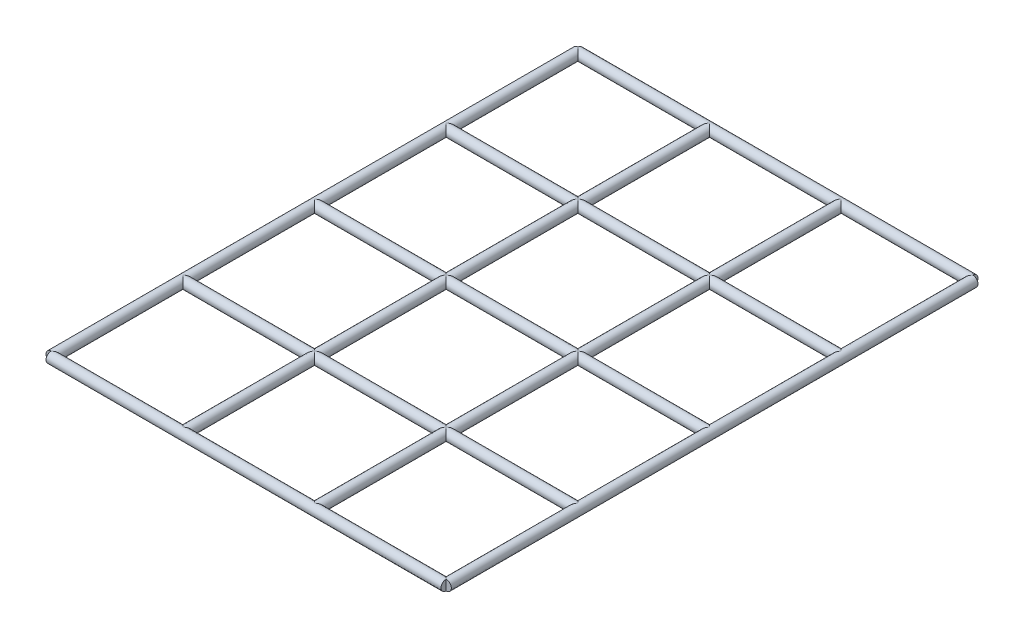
ISO-10303-21;
HEADER;
FILE_DESCRIPTION(('STEP AP214'),'2;1');
FILE_NAME('part.step','',(''),(''),'','','');
FILE_SCHEMA(('AUTOMOTIVE_DESIGN { 1 0 10303 214 1 1 1 1 }'));
ENDSEC;
DATA;
#1=APPLICATION_CONTEXT('core data for automotive mechanical design processes');
#2=APPLICATION_PROTOCOL_DEFINITION('international standard','automotive_design',2000,#1);
#3=PRODUCT_CONTEXT('',#1,'mechanical');
#4=PRODUCT('Part','Part','',(#3));
#5=PRODUCT_RELATED_PRODUCT_CATEGORY('part','',(#4));
#6=PRODUCT_DEFINITION_FORMATION('','',#4);
#7=PRODUCT_DEFINITION_CONTEXT('part definition',#1,'design');
#8=PRODUCT_DEFINITION('design','',#6,#7);
#9=PRODUCT_DEFINITION_SHAPE('','',#8);
#10=(LENGTH_UNIT() NAMED_UNIT(*) SI_UNIT(.MILLI.,.METRE.));
#11=(NAMED_UNIT(*) PLANE_ANGLE_UNIT() SI_UNIT($,.RADIAN.));
#12=(NAMED_UNIT(*) SI_UNIT($,.STERADIAN.) SOLID_ANGLE_UNIT());
#13=UNCERTAINTY_MEASURE_WITH_UNIT(LENGTH_MEASURE(1.E-05),#10,'distance_accuracy_value','');
#14=(GEOMETRIC_REPRESENTATION_CONTEXT(3) GLOBAL_UNCERTAINTY_ASSIGNED_CONTEXT((#13)) GLOBAL_UNIT_ASSIGNED_CONTEXT((#10,
#11,#12)) REPRESENTATION_CONTEXT('',''));
#15=CARTESIAN_POINT('',(0.,0.,0.));
#16=DIRECTION('',(0.,0.,1.));
#17=DIRECTION('',(1.,0.,0.));
#18=AXIS2_PLACEMENT_3D('',#15,#16,#17);
#19=CARTESIAN_POINT('',(0.,0.,-203.2));
#20=DIRECTION('',(0.,0.,1.));
#21=DIRECTION('',(1.,0.,0.));
#22=AXIS2_PLACEMENT_3D('',#19,#20,#21);
#23=CYLINDRICAL_SURFACE('',#22,1.9812);
#24=CARTESIAN_POINT('',(0.,0.,-152.4));
#25=DIRECTION('',(0.707106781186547,0.,0.707106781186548));
#26=DIRECTION('',(-0.707106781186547,0.,0.707106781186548));
#27=AXIS2_PLACEMENT_3D('',#24,#25,#26);
#28=ELLIPSE('',#27,2.80183990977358,1.9812);
#29=CARTESIAN_POINT('',(0.,1.9812,-152.4));
#30=VERTEX_POINT('',#29);
#31=CARTESIAN_POINT('',(0.,-1.9812,-152.4));
#32=VERTEX_POINT('',#31);
#33=EDGE_CURVE('E278',#30,#32,#28,.F.);
#34=ORIENTED_EDGE('',*,*,#33,.T.);
#35=CARTESIAN_POINT('',(0.,0.,-152.4));
#36=DIRECTION('',(-0.707106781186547,0.,0.707106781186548));
#37=DIRECTION('',(0.707106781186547,0.,0.707106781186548));
#38=AXIS2_PLACEMENT_3D('',#35,#36,#37);
#39=ELLIPSE('',#38,2.80183990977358,1.9812);
#40=EDGE_CURVE('E318',#32,#30,#39,.T.);
#41=ORIENTED_EDGE('',*,*,#40,.T.);
#42=EDGE_LOOP('',(#34,#41));
#43=FACE_BOUND('',#42,.T.);
#44=CARTESIAN_POINT('',(0.,0.,-50.8));
#45=DIRECTION('',(0.707106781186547,0.,0.707106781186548));
#46=DIRECTION('',(-0.707106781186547,0.,0.707106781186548));
#47=AXIS2_PLACEMENT_3D('',#44,#45,#46);
#48=ELLIPSE('',#47,2.80183990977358,1.9812);
#49=CARTESIAN_POINT('',(0.,1.9812,-50.8));
#50=VERTEX_POINT('',#49);
#51=CARTESIAN_POINT('',(0.,-1.9812,-50.8));
#52=VERTEX_POINT('',#51);
#53=EDGE_CURVE('E282',#50,#52,#48,.F.);
#54=ORIENTED_EDGE('',*,*,#53,.T.);
#55=CARTESIAN_POINT('',(0.,0.,-50.8));
#56=DIRECTION('',(-0.707106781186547,0.,0.707106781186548));
#57=DIRECTION('',(0.707106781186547,0.,0.707106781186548));
#58=AXIS2_PLACEMENT_3D('',#55,#56,#57);
#59=ELLIPSE('',#58,2.80183990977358,1.9812);
#60=EDGE_CURVE('E187',#52,#50,#59,.T.);
#61=ORIENTED_EDGE('',*,*,#60,.T.);
#62=EDGE_LOOP('',(#54,#61));
#63=FACE_BOUND('',#62,.T.);
#64=CARTESIAN_POINT('',(0.,0.,0.));
#65=DIRECTION('',(0.,0.,1.));
#66=DIRECTION('',(1.,0.,0.));
#67=AXIS2_PLACEMENT_3D('',#64,#65,#66);
#68=CIRCLE('',#67,1.9812);
#69=CARTESIAN_POINT('',(0.,1.9812,0.));
#70=VERTEX_POINT('',#69);
#71=CARTESIAN_POINT('',(0.,-1.9812,0.));
#72=VERTEX_POINT('',#71);
#73=EDGE_CURVE('E198',#70,#72,#68,.T.);
#74=ORIENTED_EDGE('',*,*,#73,.F.);
#75=CARTESIAN_POINT('',(0.,0.,0.));
#76=DIRECTION('',(0.707106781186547,0.,0.707106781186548));
#77=DIRECTION('',(-0.707106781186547,0.,0.707106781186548));
#78=AXIS2_PLACEMENT_3D('',#75,#76,#77);
#79=ELLIPSE('',#78,2.80183990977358,1.9812);
#80=EDGE_CURVE('E195',#70,#72,#79,.F.);
#81=ORIENTED_EDGE('',*,*,#80,.T.);
#82=EDGE_LOOP('',(#74,#81));
#83=FACE_BOUND('',#82,.T.);
#84=CARTESIAN_POINT('',(0.,0.,-101.6));
#85=DIRECTION('',(0.707106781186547,0.,0.707106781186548));
#86=DIRECTION('',(-0.707106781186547,0.,0.707106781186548));
#87=AXIS2_PLACEMENT_3D('',#84,#85,#86);
#88=ELLIPSE('',#87,2.80183990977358,1.9812);
#89=CARTESIAN_POINT('',(0.,1.9812,-101.6));
#90=VERTEX_POINT('',#89);
#91=CARTESIAN_POINT('',(0.,-1.9812,-101.6));
#92=VERTEX_POINT('',#91);
#93=EDGE_CURVE('E288',#90,#92,#88,.F.);
#94=ORIENTED_EDGE('',*,*,#93,.T.);
#95=CARTESIAN_POINT('',(0.,0.,-101.6));
#96=DIRECTION('',(-0.707106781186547,0.,0.707106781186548));
#97=DIRECTION('',(0.707106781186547,0.,0.707106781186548));
#98=AXIS2_PLACEMENT_3D('',#95,#96,#97);
#99=ELLIPSE('',#98,2.80183990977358,1.9812);
#100=EDGE_CURVE('E338',#92,#90,#99,.T.);
#101=ORIENTED_EDGE('',*,*,#100,.T.);
#102=EDGE_LOOP('',(#94,#101));
#103=FACE_BOUND('',#102,.T.);
#104=CARTESIAN_POINT('',(0.,0.,-203.2));
#105=DIRECTION('',(0.,0.,1.));
#106=DIRECTION('',(1.,0.,0.));
#107=AXIS2_PLACEMENT_3D('',#104,#105,#106);
#108=CIRCLE('',#107,1.9812);
#109=CARTESIAN_POINT('',(0.,1.9812,-203.2));
#110=VERTEX_POINT('',#109);
#111=CARTESIAN_POINT('',(0.,-1.9812,-203.2));
#112=VERTEX_POINT('',#111);
#113=EDGE_CURVE('E201',#110,#112,#108,.T.);
#114=ORIENTED_EDGE('',*,*,#113,.T.);
#115=CARTESIAN_POINT('',(0.,0.,-203.2));
#116=DIRECTION('',(-0.707106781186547,0.,0.707106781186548));
#117=DIRECTION('',(0.707106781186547,0.,0.707106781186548));
#118=AXIS2_PLACEMENT_3D('',#115,#116,#117);
#119=ELLIPSE('',#118,2.80183990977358,1.9812);
#120=EDGE_CURVE('E176',#112,#110,#119,.T.);
#121=ORIENTED_EDGE('',*,*,#120,.T.);
#122=EDGE_LOOP('',(#114,#121));
#123=FACE_BOUND('',#122,.T.);
#124=ADVANCED_FACE('F28',(#43,#63,#83,#103,#123),#23,.T.);
#125=CARTESIAN_POINT('',(152.4,0.,-203.2));
#126=DIRECTION('',(0.,0.,1.));
#127=DIRECTION('',(1.,0.,0.));
#128=AXIS2_PLACEMENT_3D('',#125,#126,#127);
#129=CYLINDRICAL_SURFACE('',#128,1.9812);
#130=CARTESIAN_POINT('',(152.4,0.,-152.4));
#131=DIRECTION('',(0.707106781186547,0.,0.707106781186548));
#132=DIRECTION('',(-0.707106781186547,0.,0.707106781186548));
#133=AXIS2_PLACEMENT_3D('',#130,#131,#132);
#134=ELLIPSE('',#133,2.80183990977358,1.9812);
#135=CARTESIAN_POINT('',(152.4,1.9812,-152.4));
#136=VERTEX_POINT('',#135);
#137=CARTESIAN_POINT('',(152.4,-1.9812,-152.4));
#138=VERTEX_POINT('',#137);
#139=EDGE_CURVE('E311',#136,#138,#134,.T.);
#140=ORIENTED_EDGE('',*,*,#139,.T.);
#141=CARTESIAN_POINT('',(152.4,0.,-152.4));
#142=DIRECTION('',(-0.707106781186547,0.,0.707106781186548));
#143=DIRECTION('',(0.707106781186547,0.,0.707106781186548));
#144=AXIS2_PLACEMENT_3D('',#141,#142,#143);
#145=ELLIPSE('',#144,2.80183990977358,1.9812);
#146=EDGE_CURVE('E314',#138,#136,#145,.F.);
#147=ORIENTED_EDGE('',*,*,#146,.T.);
#148=EDGE_LOOP('',(#140,#147));
#149=FACE_BOUND('',#148,.T.);
#150=CARTESIAN_POINT('',(152.4,0.,-50.8));
#151=DIRECTION('',(0.707106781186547,0.,0.707106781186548));
#152=DIRECTION('',(-0.707106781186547,0.,0.707106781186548));
#153=AXIS2_PLACEMENT_3D('',#150,#151,#152);
#154=ELLIPSE('',#153,2.80183990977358,1.9812);
#155=CARTESIAN_POINT('',(152.4,1.9812,-50.8));
#156=VERTEX_POINT('',#155);
#157=CARTESIAN_POINT('',(152.4,-1.9812,-50.8));
#158=VERTEX_POINT('',#157);
#159=EDGE_CURVE('E221',#156,#158,#154,.T.);
#160=ORIENTED_EDGE('',*,*,#159,.T.);
#161=CARTESIAN_POINT('',(152.4,0.,-50.8));
#162=DIRECTION('',(-0.707106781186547,0.,0.707106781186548));
#163=DIRECTION('',(0.707106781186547,0.,0.707106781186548));
#164=AXIS2_PLACEMENT_3D('',#161,#162,#163);
#165=ELLIPSE('',#164,2.80183990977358,1.9812);
#166=EDGE_CURVE('E224',#158,#156,#165,.F.);
#167=ORIENTED_EDGE('',*,*,#166,.T.);
#168=EDGE_LOOP('',(#160,#167));
#169=FACE_BOUND('',#168,.T.);
#170=CARTESIAN_POINT('',(152.4,0.,0.));
#171=DIRECTION('',(-0.707106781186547,0.,0.707106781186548));
#172=DIRECTION('',(-0.707106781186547,0.,-0.707106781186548));
#173=AXIS2_PLACEMENT_3D('',#170,#171,#172);
#174=ELLIPSE('',#173,2.80183990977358,1.9812);
#175=CARTESIAN_POINT('',(152.4,1.9812,0.));
#176=VERTEX_POINT('',#175);
#177=CARTESIAN_POINT('',(152.4,-1.9812,0.));
#178=VERTEX_POINT('',#177);
#179=EDGE_CURVE('E180',#176,#178,#174,.T.);
#180=ORIENTED_EDGE('',*,*,#179,.F.);
#181=CARTESIAN_POINT('',(152.4,0.,0.));
#182=DIRECTION('',(0.,0.,1.));
#183=DIRECTION('',(1.,0.,0.));
#184=AXIS2_PLACEMENT_3D('',#181,#182,#183);
#185=CIRCLE('',#184,1.9812);
#186=EDGE_CURVE('E181',#178,#176,#185,.T.);
#187=ORIENTED_EDGE('',*,*,#186,.F.);
#188=EDGE_LOOP('',(#180,#187));
#189=FACE_BOUND('',#188,.T.);
#190=CARTESIAN_POINT('',(152.4,0.,-101.6));
#191=DIRECTION('',(0.707106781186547,0.,0.707106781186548));
#192=DIRECTION('',(-0.707106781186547,0.,0.707106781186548));
#193=AXIS2_PLACEMENT_3D('',#190,#191,#192);
#194=ELLIPSE('',#193,2.80183990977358,1.9812);
#195=CARTESIAN_POINT('',(152.4,1.9812,-101.6));
#196=VERTEX_POINT('',#195);
#197=CARTESIAN_POINT('',(152.4,-1.9812,-101.6));
#198=VERTEX_POINT('',#197);
#199=EDGE_CURVE('E331',#196,#198,#194,.T.);
#200=ORIENTED_EDGE('',*,*,#199,.T.);
#201=CARTESIAN_POINT('',(152.4,0.,-101.6));
#202=DIRECTION('',(-0.707106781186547,0.,0.707106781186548));
#203=DIRECTION('',(0.707106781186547,0.,0.707106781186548));
#204=AXIS2_PLACEMENT_3D('',#201,#202,#203);
#205=ELLIPSE('',#204,2.80183990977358,1.9812);
#206=EDGE_CURVE('E334',#198,#196,#205,.F.);
#207=ORIENTED_EDGE('',*,*,#206,.T.);
#208=EDGE_LOOP('',(#200,#207));
#209=FACE_BOUND('',#208,.T.);
#210=CARTESIAN_POINT('',(152.4,0.,-203.2));
#211=DIRECTION('',(0.,0.,1.));
#212=DIRECTION('',(1.,0.,0.));
#213=AXIS2_PLACEMENT_3D('',#210,#211,#212);
#214=CIRCLE('',#213,1.9812);
#215=CARTESIAN_POINT('',(152.4,-1.9812,-203.2));
#216=VERTEX_POINT('',#215);
#217=CARTESIAN_POINT('',(152.4,1.9812,-203.2));
#218=VERTEX_POINT('',#217);
#219=EDGE_CURVE('E175',#216,#218,#214,.T.);
#220=ORIENTED_EDGE('',*,*,#219,.T.);
#221=CARTESIAN_POINT('',(152.4,0.,-203.2));
#222=DIRECTION('',(0.707106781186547,0.,0.707106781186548));
#223=DIRECTION('',(-0.707106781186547,0.,0.707106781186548));
#224=AXIS2_PLACEMENT_3D('',#221,#222,#223);
#225=ELLIPSE('',#224,2.80183990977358,1.9812);
#226=EDGE_CURVE('E169',#218,#216,#225,.T.);
#227=ORIENTED_EDGE('',*,*,#226,.T.);
#228=EDGE_LOOP('',(#220,#227));
#229=FACE_BOUND('',#228,.T.);
#230=ADVANCED_FACE('F174',(#149,#169,#189,#209,#229),#129,.T.);
#231=CARTESIAN_POINT('',(0.,0.,-203.2));
#232=DIRECTION('',(0.,0.,1.));
#233=DIRECTION('',(1.,0.,0.));
#234=AXIS2_PLACEMENT_3D('',#231,#232,#233);
#235=PLANE('',#234);
#236=DIRECTION('',(0.,1.,0.));
#237=VECTOR('',#236,1.);
#238=CARTESIAN_POINT('',(0.,0.,-203.2));
#239=LINE('',#238,#237);
#240=EDGE_CURVE('E11',#112,#110,#239,.T.);
#241=ORIENTED_EDGE('',*,*,#240,.F.);
#242=ORIENTED_EDGE('',*,*,#113,.F.);
#243=EDGE_LOOP('',(#241,#242));
#244=FACE_BOUND('',#243,.T.);
#245=ADVANCED_FACE('F272',(#244),#235,.F.);
#246=CARTESIAN_POINT('',(101.6,0.,-203.2));
#247=DIRECTION('',(0.,0.,1.));
#248=DIRECTION('',(1.,0.,0.));
#249=AXIS2_PLACEMENT_3D('',#246,#247,#248);
#250=CYLINDRICAL_SURFACE('',#249,1.9812);
#251=CARTESIAN_POINT('',(101.6,0.,-152.4));
#252=DIRECTION('',(0.707106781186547,0.,0.707106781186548));
#253=DIRECTION('',(-0.707106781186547,0.,0.707106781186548));
#254=AXIS2_PLACEMENT_3D('',#251,#252,#253);
#255=ELLIPSE('',#254,2.80183990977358,1.9812);
#256=CARTESIAN_POINT('',(101.6,1.9812,-152.4));
#257=VERTEX_POINT('',#256);
#258=CARTESIAN_POINT('',(101.6,-1.9812,-152.4));
#259=VERTEX_POINT('',#258);
#260=EDGE_CURVE('E292',#257,#259,#255,.F.);
#261=ORIENTED_EDGE('',*,*,#260,.T.);
#262=CARTESIAN_POINT('',(101.6,0.,-152.4));
#263=DIRECTION('',(-0.707106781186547,0.,0.707106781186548));
#264=DIRECTION('',(0.707106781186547,0.,0.707106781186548));
#265=AXIS2_PLACEMENT_3D('',#262,#263,#264);
#266=ELLIPSE('',#265,2.80183990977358,1.9812);
#267=EDGE_CURVE('E308',#259,#257,#266,.F.);
#268=ORIENTED_EDGE('',*,*,#267,.T.);
#269=EDGE_LOOP('',(#261,#268));
#270=FACE_BOUND('',#269,.T.);
#271=CARTESIAN_POINT('',(101.6,0.,-203.2));
#272=DIRECTION('',(0.707106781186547,0.,0.707106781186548));
#273=DIRECTION('',(-0.707106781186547,0.,0.707106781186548));
#274=AXIS2_PLACEMENT_3D('',#271,#272,#273);
#275=ELLIPSE('',#274,2.80183990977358,1.9812);
#276=CARTESIAN_POINT('',(101.6,1.9812,-203.2));
#277=VERTEX_POINT('',#276);
#278=CARTESIAN_POINT('',(101.6,-1.9812,-203.2));
#279=VERTEX_POINT('',#278);
#280=EDGE_CURVE('E170',#277,#279,#275,.T.);
#281=ORIENTED_EDGE('',*,*,#280,.T.);
#282=CARTESIAN_POINT('',(101.6,0.,-203.2));
#283=DIRECTION('',(-0.707106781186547,0.,0.707106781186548));
#284=DIRECTION('',(0.707106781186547,0.,0.707106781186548));
#285=AXIS2_PLACEMENT_3D('',#282,#283,#284);
#286=ELLIPSE('',#285,2.80183990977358,1.9812);
#287=EDGE_CURVE('E177',#279,#277,#286,.T.);
#288=ORIENTED_EDGE('',*,*,#287,.T.);
#289=EDGE_LOOP('',(#281,#288));
#290=FACE_BOUND('',#289,.T.);
#291=ADVANCED_FACE('F403',(#270,#290),#250,.T.);
#292=CARTESIAN_POINT('',(50.8,0.,-203.2));
#293=DIRECTION('',(0.,0.,1.));
#294=DIRECTION('',(1.,0.,0.));
#295=AXIS2_PLACEMENT_3D('',#292,#293,#294);
#296=CYLINDRICAL_SURFACE('',#295,1.9812);
#297=CARTESIAN_POINT('',(50.8,0.,-152.4));
#298=DIRECTION('',(0.707106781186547,0.,0.707106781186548));
#299=DIRECTION('',(-0.707106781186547,0.,0.707106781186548));
#300=AXIS2_PLACEMENT_3D('',#297,#298,#299);
#301=ELLIPSE('',#300,2.80183990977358,1.9812);
#302=CARTESIAN_POINT('',(50.8,1.9812,-152.4));
#303=VERTEX_POINT('',#302);
#304=CARTESIAN_POINT('',(50.8,-1.9812,-152.4));
#305=VERTEX_POINT('',#304);
#306=EDGE_CURVE('E238',#303,#305,#301,.F.);
#307=ORIENTED_EDGE('',*,*,#306,.T.);
#308=CARTESIAN_POINT('',(50.8,0.,-152.4));
#309=DIRECTION('',(-0.707106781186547,0.,0.707106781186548));
#310=DIRECTION('',(0.707106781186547,0.,0.707106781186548));
#311=AXIS2_PLACEMENT_3D('',#308,#309,#310);
#312=ELLIPSE('',#311,2.80183990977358,1.9812);
#313=EDGE_CURVE('E246',#305,#303,#312,.F.);
#314=ORIENTED_EDGE('',*,*,#313,.T.);
#315=EDGE_LOOP('',(#307,#314));
#316=FACE_BOUND('',#315,.T.);
#317=CARTESIAN_POINT('',(50.8,0.,-203.2));
#318=DIRECTION('',(0.707106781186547,0.,0.707106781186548));
#319=DIRECTION('',(-0.707106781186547,0.,0.707106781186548));
#320=AXIS2_PLACEMENT_3D('',#317,#318,#319);
#321=ELLIPSE('',#320,2.80183990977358,1.9812);
#322=CARTESIAN_POINT('',(50.8,1.9812,-203.2));
#323=VERTEX_POINT('',#322);
#324=CARTESIAN_POINT('',(50.8,-1.9812,-203.2));
#325=VERTEX_POINT('',#324);
#326=EDGE_CURVE('E249',#323,#325,#321,.T.);
#327=ORIENTED_EDGE('',*,*,#326,.T.);
#328=CARTESIAN_POINT('',(50.8,0.,-203.2));
#329=DIRECTION('',(-0.707106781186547,0.,0.707106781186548));
#330=DIRECTION('',(0.707106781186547,0.,0.707106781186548));
#331=AXIS2_PLACEMENT_3D('',#328,#329,#330);
#332=ELLIPSE('',#331,2.80183990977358,1.9812);
#333=EDGE_CURVE('E164',#325,#323,#332,.T.);
#334=ORIENTED_EDGE('',*,*,#333,.T.);
#335=EDGE_LOOP('',(#327,#334));
#336=FACE_BOUND('',#335,.T.);
#337=ADVANCED_FACE('F254',(#316,#336),#296,.T.);
#338=CARTESIAN_POINT('',(101.6,0.,-101.6));
#339=DIRECTION('',(0.707106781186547,0.,0.707106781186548));
#340=DIRECTION('',(-0.707106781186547,0.,0.707106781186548));
#341=AXIS2_PLACEMENT_3D('',#338,#339,#340);
#342=ELLIPSE('',#341,2.80183990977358,1.9812);
#343=CARTESIAN_POINT('',(101.6,1.9812,-101.6));
#344=VERTEX_POINT('',#343);
#345=CARTESIAN_POINT('',(101.6,-1.9812,-101.6));
#346=VERTEX_POINT('',#345);
#347=EDGE_CURVE('E320',#344,#346,#342,.F.);
#348=ORIENTED_EDGE('',*,*,#347,.T.);
#349=CARTESIAN_POINT('',(101.6,0.,-101.6));
#350=DIRECTION('',(-0.707106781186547,0.,0.707106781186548));
#351=DIRECTION('',(0.707106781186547,0.,0.707106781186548));
#352=AXIS2_PLACEMENT_3D('',#349,#350,#351);
#353=ELLIPSE('',#352,2.80183990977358,1.9812);
#354=EDGE_CURVE('E328',#346,#344,#353,.F.);
#355=ORIENTED_EDGE('',*,*,#354,.T.);
#356=EDGE_LOOP('',(#348,#355));
#357=FACE_BOUND('',#356,.T.);
#358=CARTESIAN_POINT('',(101.6,0.,-152.4));
#359=DIRECTION('',(0.707106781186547,0.,0.707106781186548));
#360=DIRECTION('',(-0.707106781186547,0.,0.707106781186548));
#361=AXIS2_PLACEMENT_3D('',#358,#359,#360);
#362=ELLIPSE('',#361,2.80183990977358,1.9812);
#363=EDGE_CURVE('E302',#257,#259,#362,.T.);
#364=ORIENTED_EDGE('',*,*,#363,.T.);
#365=CARTESIAN_POINT('',(101.6,0.,-152.4));
#366=DIRECTION('',(-0.707106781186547,0.,0.707106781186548));
#367=DIRECTION('',(0.707106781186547,0.,0.707106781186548));
#368=AXIS2_PLACEMENT_3D('',#365,#366,#367);
#369=ELLIPSE('',#368,2.80183990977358,1.9812);
#370=EDGE_CURVE('E305',#259,#257,#369,.T.);
#371=ORIENTED_EDGE('',*,*,#370,.T.);
#372=EDGE_LOOP('',(#364,#371));
#373=FACE_BOUND('',#372,.T.);
#374=ADVANCED_FACE('F393',(#357,#373),#250,.T.);
#375=CARTESIAN_POINT('',(50.8,0.,-101.6));
#376=DIRECTION('',(0.707106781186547,0.,0.707106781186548));
#377=DIRECTION('',(-0.707106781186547,0.,0.707106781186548));
#378=AXIS2_PLACEMENT_3D('',#375,#376,#377);
#379=ELLIPSE('',#378,2.80183990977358,1.9812);
#380=CARTESIAN_POINT('',(50.8,1.9812,-101.6));
#381=VERTEX_POINT('',#380);
#382=CARTESIAN_POINT('',(50.8,-1.9812,-101.6));
#383=VERTEX_POINT('',#382);
#384=EDGE_CURVE('E227',#381,#383,#379,.F.);
#385=ORIENTED_EDGE('',*,*,#384,.T.);
#386=CARTESIAN_POINT('',(50.8,0.,-101.6));
#387=DIRECTION('',(-0.707106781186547,0.,0.707106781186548));
#388=DIRECTION('',(0.707106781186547,0.,0.707106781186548));
#389=AXIS2_PLACEMENT_3D('',#386,#387,#388);
#390=ELLIPSE('',#389,2.80183990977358,1.9812);
#391=EDGE_CURVE('E235',#383,#381,#390,.F.);
#392=ORIENTED_EDGE('',*,*,#391,.T.);
#393=EDGE_LOOP('',(#385,#392));
#394=FACE_BOUND('',#393,.T.);
#395=CARTESIAN_POINT('',(50.8,0.,-152.4));
#396=DIRECTION('',(0.707106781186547,0.,0.707106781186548));
#397=DIRECTION('',(-0.707106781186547,0.,0.707106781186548));
#398=AXIS2_PLACEMENT_3D('',#395,#396,#397);
#399=ELLIPSE('',#398,2.80183990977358,1.9812);
#400=EDGE_CURVE('E240',#303,#305,#399,.T.);
#401=ORIENTED_EDGE('',*,*,#400,.T.);
#402=CARTESIAN_POINT('',(50.8,0.,-152.4));
#403=DIRECTION('',(-0.707106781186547,0.,0.707106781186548));
#404=DIRECTION('',(0.707106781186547,0.,0.707106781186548));
#405=AXIS2_PLACEMENT_3D('',#402,#403,#404);
#406=ELLIPSE('',#405,2.80183990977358,1.9812);
#407=EDGE_CURVE('E243',#305,#303,#406,.T.);
#408=ORIENTED_EDGE('',*,*,#407,.T.);
#409=EDGE_LOOP('',(#401,#408));
#410=FACE_BOUND('',#409,.T.);
#411=ADVANCED_FACE('F383',(#394,#410),#296,.T.);
#412=CARTESIAN_POINT('',(101.6,0.,-50.8));
#413=DIRECTION('',(0.707106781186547,0.,0.707106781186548));
#414=DIRECTION('',(-0.707106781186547,0.,0.707106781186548));
#415=AXIS2_PLACEMENT_3D('',#412,#413,#414);
#416=ELLIPSE('',#415,2.80183990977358,1.9812);
#417=CARTESIAN_POINT('',(101.6,1.9812,-50.8));
#418=VERTEX_POINT('',#417);
#419=CARTESIAN_POINT('',(101.6,-1.9812,-50.8));
#420=VERTEX_POINT('',#419);
#421=EDGE_CURVE('E340',#418,#420,#416,.F.);
#422=ORIENTED_EDGE('',*,*,#421,.T.);
#423=CARTESIAN_POINT('',(101.6,0.,-50.8));
#424=DIRECTION('',(-0.707106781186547,0.,0.707106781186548));
#425=DIRECTION('',(0.707106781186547,0.,0.707106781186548));
#426=AXIS2_PLACEMENT_3D('',#423,#424,#425);
#427=ELLIPSE('',#426,2.80183990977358,1.9812);
#428=EDGE_CURVE('E348',#420,#418,#427,.F.);
#429=ORIENTED_EDGE('',*,*,#428,.T.);
#430=EDGE_LOOP('',(#422,#429));
#431=FACE_BOUND('',#430,.T.);
#432=CARTESIAN_POINT('',(101.6,0.,-101.6));
#433=DIRECTION('',(0.707106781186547,0.,0.707106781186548));
#434=DIRECTION('',(-0.707106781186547,0.,0.707106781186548));
#435=AXIS2_PLACEMENT_3D('',#432,#433,#434);
#436=ELLIPSE('',#435,2.80183990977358,1.9812);
#437=EDGE_CURVE('E322',#344,#346,#436,.T.);
#438=ORIENTED_EDGE('',*,*,#437,.T.);
#439=CARTESIAN_POINT('',(101.6,0.,-101.6));
#440=DIRECTION('',(-0.707106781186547,0.,0.707106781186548));
#441=DIRECTION('',(0.707106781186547,0.,0.707106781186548));
#442=AXIS2_PLACEMENT_3D('',#439,#440,#441);
#443=ELLIPSE('',#442,2.80183990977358,1.9812);
#444=EDGE_CURVE('E325',#346,#344,#443,.T.);
#445=ORIENTED_EDGE('',*,*,#444,.T.);
#446=EDGE_LOOP('',(#438,#445));
#447=FACE_BOUND('',#446,.T.);
#448=ADVANCED_FACE('F381',(#431,#447),#250,.T.);
#449=CARTESIAN_POINT('',(50.8,0.,-50.8));
#450=DIRECTION('',(0.707106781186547,0.,0.707106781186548));
#451=DIRECTION('',(-0.707106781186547,0.,0.707106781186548));
#452=AXIS2_PLACEMENT_3D('',#449,#450,#451);
#453=ELLIPSE('',#452,2.80183990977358,1.9812);
#454=CARTESIAN_POINT('',(50.8,1.9812,-50.8));
#455=VERTEX_POINT('',#454);
#456=CARTESIAN_POINT('',(50.8,-1.9812,-50.8));
#457=VERTEX_POINT('',#456);
#458=EDGE_CURVE('E351',#455,#457,#453,.F.);
#459=ORIENTED_EDGE('',*,*,#458,.T.);
#460=CARTESIAN_POINT('',(50.8,0.,-50.8));
#461=DIRECTION('',(-0.707106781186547,0.,0.707106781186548));
#462=DIRECTION('',(0.707106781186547,0.,0.707106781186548));
#463=AXIS2_PLACEMENT_3D('',#460,#461,#462);
#464=ELLIPSE('',#463,2.80183990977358,1.9812);
#465=EDGE_CURVE('E359',#457,#455,#464,.F.);
#466=ORIENTED_EDGE('',*,*,#465,.T.);
#467=EDGE_LOOP('',(#459,#466));
#468=FACE_BOUND('',#467,.T.);
#469=CARTESIAN_POINT('',(50.8,0.,-101.6));
#470=DIRECTION('',(0.707106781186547,0.,0.707106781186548));
#471=DIRECTION('',(-0.707106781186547,0.,0.707106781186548));
#472=AXIS2_PLACEMENT_3D('',#469,#470,#471);
#473=ELLIPSE('',#472,2.80183990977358,1.9812);
#474=EDGE_CURVE('E229',#381,#383,#473,.T.);
#475=ORIENTED_EDGE('',*,*,#474,.T.);
#476=CARTESIAN_POINT('',(50.8,0.,-101.6));
#477=DIRECTION('',(-0.707106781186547,0.,0.707106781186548));
#478=DIRECTION('',(0.707106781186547,0.,0.707106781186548));
#479=AXIS2_PLACEMENT_3D('',#476,#477,#478);
#480=ELLIPSE('',#479,2.80183990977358,1.9812);
#481=EDGE_CURVE('E232',#383,#381,#480,.T.);
#482=ORIENTED_EDGE('',*,*,#481,.T.);
#483=EDGE_LOOP('',(#475,#482));
#484=FACE_BOUND('',#483,.T.);
#485=ADVANCED_FACE('F378',(#468,#484),#296,.T.);
#486=CARTESIAN_POINT('',(50.8,0.,0.));
#487=DIRECTION('',(-0.707106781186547,0.,0.707106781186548));
#488=DIRECTION('',(-0.707106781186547,0.,-0.707106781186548));
#489=AXIS2_PLACEMENT_3D('',#486,#487,#488);
#490=ELLIPSE('',#489,2.80183990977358,1.9812);
#491=CARTESIAN_POINT('',(50.8,1.9812,0.));
#492=VERTEX_POINT('',#491);
#493=CARTESIAN_POINT('',(50.8,-1.9812,0.));
#494=VERTEX_POINT('',#493);
#495=EDGE_CURVE('E209',#492,#494,#490,.T.);
#496=ORIENTED_EDGE('',*,*,#495,.F.);
#497=CARTESIAN_POINT('',(50.8,0.,0.));
#498=DIRECTION('',(-0.707106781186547,0.,-0.707106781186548));
#499=DIRECTION('',(-0.707106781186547,0.,0.707106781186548));
#500=AXIS2_PLACEMENT_3D('',#497,#498,#499);
#501=ELLIPSE('',#500,2.80183990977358,1.9812);
#502=EDGE_CURVE('E206',#494,#492,#501,.F.);
#503=ORIENTED_EDGE('',*,*,#502,.F.);
#504=EDGE_LOOP('',(#496,#503));
#505=FACE_BOUND('',#504,.T.);
#506=CARTESIAN_POINT('',(50.8,0.,-50.8));
#507=DIRECTION('',(0.707106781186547,0.,0.707106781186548));
#508=DIRECTION('',(-0.707106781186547,0.,0.707106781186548));
#509=AXIS2_PLACEMENT_3D('',#506,#507,#508);
#510=ELLIPSE('',#509,2.80183990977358,1.9812);
#511=EDGE_CURVE('E353',#455,#457,#510,.T.);
#512=ORIENTED_EDGE('',*,*,#511,.T.);
#513=CARTESIAN_POINT('',(50.8,0.,-50.8));
#514=DIRECTION('',(-0.707106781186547,0.,0.707106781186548));
#515=DIRECTION('',(0.707106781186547,0.,0.707106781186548));
#516=AXIS2_PLACEMENT_3D('',#513,#514,#515);
#517=ELLIPSE('',#516,2.80183990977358,1.9812);
#518=EDGE_CURVE('E356',#457,#455,#517,.T.);
#519=ORIENTED_EDGE('',*,*,#518,.T.);
#520=EDGE_LOOP('',(#512,#519));
#521=FACE_BOUND('',#520,.T.);
#522=ADVANCED_FACE('F374',(#505,#521),#296,.T.);
#523=CARTESIAN_POINT('',(101.6,0.,0.));
#524=DIRECTION('',(-0.707106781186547,0.,0.707106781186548));
#525=DIRECTION('',(-0.707106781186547,0.,-0.707106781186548));
#526=AXIS2_PLACEMENT_3D('',#523,#524,#525);
#527=ELLIPSE('',#526,2.80183990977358,1.9812);
#528=CARTESIAN_POINT('',(101.6,1.9812,0.));
#529=VERTEX_POINT('',#528);
#530=CARTESIAN_POINT('',(101.6,-1.9812,0.));
#531=VERTEX_POINT('',#530);
#532=EDGE_CURVE('E215',#529,#531,#527,.T.);
#533=ORIENTED_EDGE('',*,*,#532,.F.);
#534=CARTESIAN_POINT('',(101.6,0.,0.));
#535=DIRECTION('',(-0.707106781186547,0.,-0.707106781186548));
#536=DIRECTION('',(-0.707106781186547,0.,0.707106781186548));
#537=AXIS2_PLACEMENT_3D('',#534,#535,#536);
#538=ELLIPSE('',#537,2.80183990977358,1.9812);
#539=EDGE_CURVE('E212',#531,#529,#538,.F.);
#540=ORIENTED_EDGE('',*,*,#539,.F.);
#541=EDGE_LOOP('',(#533,#540));
#542=FACE_BOUND('',#541,.T.);
#543=CARTESIAN_POINT('',(101.6,0.,-50.8));
#544=DIRECTION('',(0.707106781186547,0.,0.707106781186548));
#545=DIRECTION('',(-0.707106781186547,0.,0.707106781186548));
#546=AXIS2_PLACEMENT_3D('',#543,#544,#545);
#547=ELLIPSE('',#546,2.80183990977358,1.9812);
#548=EDGE_CURVE('E342',#418,#420,#547,.T.);
#549=ORIENTED_EDGE('',*,*,#548,.T.);
#550=CARTESIAN_POINT('',(101.6,0.,-50.8));
#551=DIRECTION('',(-0.707106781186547,0.,0.707106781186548));
#552=DIRECTION('',(0.707106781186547,0.,0.707106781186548));
#553=AXIS2_PLACEMENT_3D('',#550,#551,#552);
#554=ELLIPSE('',#553,2.80183990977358,1.9812);
#555=EDGE_CURVE('E345',#420,#418,#554,.T.);
#556=ORIENTED_EDGE('',*,*,#555,.T.);
#557=EDGE_LOOP('',(#549,#556));
#558=FACE_BOUND('',#557,.T.);
#559=ADVANCED_FACE('F411',(#542,#558),#250,.T.);
#560=CARTESIAN_POINT('',(0.,0.,0.));
#561=DIRECTION('',(0.,0.,1.));
#562=DIRECTION('',(1.,0.,0.));
#563=AXIS2_PLACEMENT_3D('',#560,#561,#562);
#564=PLANE('',#563);
#565=ORIENTED_EDGE('',*,*,#73,.T.);
#566=DIRECTION('',(0.,1.,0.));
#567=VECTOR('',#566,1.);
#568=CARTESIAN_POINT('',(0.,0.,0.));
#569=LINE('',#568,#567);
#570=EDGE_CURVE('E203',#72,#70,#569,.T.);
#571=ORIENTED_EDGE('',*,*,#570,.T.);
#572=EDGE_LOOP('',(#565,#571));
#573=FACE_BOUND('',#572,.T.);
#574=ADVANCED_FACE('F418',(#573),#564,.T.);
#575=CARTESIAN_POINT('',(152.4,0.,0.));
#576=DIRECTION('',(-1.,0.,0.));
#577=DIRECTION('',(0.,0.,1.));
#578=AXIS2_PLACEMENT_3D('',#575,#576,#577);
#579=CYLINDRICAL_SURFACE('',#578,1.9812);
#580=ORIENTED_EDGE('',*,*,#539,.T.);
#581=ORIENTED_EDGE('',*,*,#532,.T.);
#582=EDGE_LOOP('',(#580,#581));
#583=FACE_BOUND('',#582,.T.);
#584=ORIENTED_EDGE('',*,*,#502,.T.);
#585=ORIENTED_EDGE('',*,*,#495,.T.);
#586=EDGE_LOOP('',(#584,#585));
#587=FACE_BOUND('',#586,.T.);
#588=ORIENTED_EDGE('',*,*,#80,.F.);
#589=CARTESIAN_POINT('',(0.,0.,0.));
#590=DIRECTION('',(1.,0.,0.));
#591=DIRECTION('',(0.,0.,-1.));
#592=AXIS2_PLACEMENT_3D('',#589,#590,#591);
#593=CIRCLE('',#592,1.9812);
#594=EDGE_CURVE('E184',#70,#72,#593,.T.);
#595=ORIENTED_EDGE('',*,*,#594,.T.);
#596=EDGE_LOOP('',(#588,#595));
#597=FACE_BOUND('',#596,.T.);
#598=CARTESIAN_POINT('',(152.4,0.,0.));
#599=DIRECTION('',(1.,0.,0.));
#600=DIRECTION('',(0.,0.,-1.));
#601=AXIS2_PLACEMENT_3D('',#598,#599,#600);
#602=CIRCLE('',#601,1.9812);
#603=EDGE_CURVE('E193',#176,#178,#602,.T.);
#604=ORIENTED_EDGE('',*,*,#603,.F.);
#605=ORIENTED_EDGE('',*,*,#179,.T.);
#606=EDGE_LOOP('',(#604,#605));
#607=FACE_BOUND('',#606,.T.);
#608=ADVANCED_FACE('F421',(#583,#587,#597,#607),#579,.T.);
#609=CARTESIAN_POINT('',(152.4,0.,0.));
#610=DIRECTION('',(1.,0.,0.));
#611=DIRECTION('',(0.,0.,-1.));
#612=AXIS2_PLACEMENT_3D('',#609,#610,#611);
#613=PLANE('',#612);
#614=DIRECTION('',(0.,-1.,0.));
#615=VECTOR('',#614,1.);
#616=CARTESIAN_POINT('',(152.4,0.,0.));
#617=LINE('',#616,#615);
#618=EDGE_CURVE('E218',#176,#178,#617,.T.);
#619=ORIENTED_EDGE('',*,*,#618,.F.);
#620=ORIENTED_EDGE('',*,*,#603,.T.);
#621=EDGE_LOOP('',(#619,#620));
#622=FACE_BOUND('',#621,.T.);
#623=ADVANCED_FACE('F424',(#622),#613,.T.);
#624=CARTESIAN_POINT('',(0.,0.,0.));
#625=DIRECTION('',(1.,0.,0.));
#626=DIRECTION('',(0.,0.,-1.));
#627=AXIS2_PLACEMENT_3D('',#624,#625,#626);
#628=PLANE('',#627);
#629=ORIENTED_EDGE('',*,*,#570,.F.);
#630=ORIENTED_EDGE('',*,*,#594,.F.);
#631=EDGE_LOOP('',(#629,#630));
#632=FACE_BOUND('',#631,.T.);
#633=ADVANCED_FACE('F438',(#632),#628,.F.);
#634=CARTESIAN_POINT('',(152.4,0.,-203.2));
#635=DIRECTION('',(0.,0.,1.));
#636=DIRECTION('',(1.,0.,0.));
#637=AXIS2_PLACEMENT_3D('',#634,#635,#636);
#638=PLANE('',#637);
#639=ORIENTED_EDGE('',*,*,#219,.F.);
#640=DIRECTION('',(0.,1.,0.));
#641=VECTOR('',#640,1.);
#642=CARTESIAN_POINT('',(152.4,0.,-203.2));
#643=LINE('',#642,#641);
#644=EDGE_CURVE('E35',#216,#218,#643,.T.);
#645=ORIENTED_EDGE('',*,*,#644,.T.);
#646=EDGE_LOOP('',(#639,#645));
#647=FACE_BOUND('',#646,.T.);
#648=ADVANCED_FACE('F179',(#647),#638,.F.);
#649=CARTESIAN_POINT('',(152.4,0.,0.));
#650=DIRECTION('',(0.,0.,1.));
#651=DIRECTION('',(1.,0.,0.));
#652=AXIS2_PLACEMENT_3D('',#649,#650,#651);
#653=PLANE('',#652);
#654=ORIENTED_EDGE('',*,*,#186,.T.);
#655=ORIENTED_EDGE('',*,*,#618,.T.);
#656=EDGE_LOOP('',(#654,#655));
#657=FACE_BOUND('',#656,.T.);
#658=ADVANCED_FACE('F436',(#657),#653,.T.);
#659=CARTESIAN_POINT('',(152.4,0.,-50.8));
#660=DIRECTION('',(-1.,0.,0.));
#661=DIRECTION('',(0.,0.,1.));
#662=AXIS2_PLACEMENT_3D('',#659,#660,#661);
#663=CYLINDRICAL_SURFACE('',#662,1.9812);
#664=ORIENTED_EDGE('',*,*,#555,.F.);
#665=ORIENTED_EDGE('',*,*,#421,.F.);
#666=EDGE_LOOP('',(#664,#665));
#667=FACE_BOUND('',#666,.T.);
#668=ORIENTED_EDGE('',*,*,#166,.F.);
#669=ORIENTED_EDGE('',*,*,#159,.F.);
#670=EDGE_LOOP('',(#668,#669));
#671=FACE_BOUND('',#670,.T.);
#672=ADVANCED_FACE('F369',(#667,#671),#663,.T.);
#673=ORIENTED_EDGE('',*,*,#518,.F.);
#674=ORIENTED_EDGE('',*,*,#458,.F.);
#675=EDGE_LOOP('',(#673,#674));
#676=FACE_BOUND('',#675,.T.);
#677=ORIENTED_EDGE('',*,*,#428,.F.);
#678=ORIENTED_EDGE('',*,*,#548,.F.);
#679=EDGE_LOOP('',(#677,#678));
#680=FACE_BOUND('',#679,.T.);
#681=ADVANCED_FACE('F367',(#676,#680),#663,.T.);
#682=ORIENTED_EDGE('',*,*,#60,.F.);
#683=ORIENTED_EDGE('',*,*,#53,.F.);
#684=EDGE_LOOP('',(#682,#683));
#685=FACE_BOUND('',#684,.T.);
#686=ORIENTED_EDGE('',*,*,#465,.F.);
#687=ORIENTED_EDGE('',*,*,#511,.F.);
#688=EDGE_LOOP('',(#686,#687));
#689=FACE_BOUND('',#688,.T.);
#690=ADVANCED_FACE('F363',(#685,#689),#663,.T.);
#691=CARTESIAN_POINT('',(152.4,0.,-101.6));
#692=DIRECTION('',(-1.,0.,0.));
#693=DIRECTION('',(0.,0.,1.));
#694=AXIS2_PLACEMENT_3D('',#691,#692,#693);
#695=CYLINDRICAL_SURFACE('',#694,1.9812);
#696=ORIENTED_EDGE('',*,*,#354,.F.);
#697=ORIENTED_EDGE('',*,*,#437,.F.);
#698=EDGE_LOOP('',(#696,#697));
#699=FACE_BOUND('',#698,.T.);
#700=ORIENTED_EDGE('',*,*,#481,.F.);
#701=ORIENTED_EDGE('',*,*,#384,.F.);
#702=EDGE_LOOP('',(#700,#701));
#703=FACE_BOUND('',#702,.T.);
#704=ADVANCED_FACE('F366',(#699,#703),#695,.T.);
#705=ORIENTED_EDGE('',*,*,#100,.F.);
#706=ORIENTED_EDGE('',*,*,#93,.F.);
#707=EDGE_LOOP('',(#705,#706));
#708=FACE_BOUND('',#707,.T.);
#709=ORIENTED_EDGE('',*,*,#391,.F.);
#710=ORIENTED_EDGE('',*,*,#474,.F.);
#711=EDGE_LOOP('',(#709,#710));
#712=FACE_BOUND('',#711,.T.);
#713=ADVANCED_FACE('F388',(#708,#712),#695,.T.);
#714=ORIENTED_EDGE('',*,*,#206,.F.);
#715=ORIENTED_EDGE('',*,*,#199,.F.);
#716=EDGE_LOOP('',(#714,#715));
#717=FACE_BOUND('',#716,.T.);
#718=ORIENTED_EDGE('',*,*,#444,.F.);
#719=ORIENTED_EDGE('',*,*,#347,.F.);
#720=EDGE_LOOP('',(#718,#719));
#721=FACE_BOUND('',#720,.T.);
#722=ADVANCED_FACE('F530',(#717,#721),#695,.T.);
#723=CARTESIAN_POINT('',(152.4,0.,-152.4));
#724=DIRECTION('',(-1.,0.,0.));
#725=DIRECTION('',(0.,0.,1.));
#726=AXIS2_PLACEMENT_3D('',#723,#724,#725);
#727=CYLINDRICAL_SURFACE('',#726,1.9812);
#728=ORIENTED_EDGE('',*,*,#267,.F.);
#729=ORIENTED_EDGE('',*,*,#363,.F.);
#730=EDGE_LOOP('',(#728,#729));
#731=FACE_BOUND('',#730,.T.);
#732=ORIENTED_EDGE('',*,*,#407,.F.);
#733=ORIENTED_EDGE('',*,*,#306,.F.);
#734=EDGE_LOOP('',(#732,#733));
#735=FACE_BOUND('',#734,.T.);
#736=ADVANCED_FACE('F400',(#731,#735),#727,.T.);
#737=ORIENTED_EDGE('',*,*,#40,.F.);
#738=ORIENTED_EDGE('',*,*,#33,.F.);
#739=EDGE_LOOP('',(#737,#738));
#740=FACE_BOUND('',#739,.T.);
#741=ORIENTED_EDGE('',*,*,#313,.F.);
#742=ORIENTED_EDGE('',*,*,#400,.F.);
#743=EDGE_LOOP('',(#741,#742));
#744=FACE_BOUND('',#743,.T.);
#745=ADVANCED_FACE('F398',(#740,#744),#727,.T.);
#746=ORIENTED_EDGE('',*,*,#146,.F.);
#747=ORIENTED_EDGE('',*,*,#139,.F.);
#748=EDGE_LOOP('',(#746,#747));
#749=FACE_BOUND('',#748,.T.);
#750=ORIENTED_EDGE('',*,*,#370,.F.);
#751=ORIENTED_EDGE('',*,*,#260,.F.);
#752=EDGE_LOOP('',(#750,#751));
#753=FACE_BOUND('',#752,.T.);
#754=ADVANCED_FACE('F549',(#749,#753),#727,.T.);
#755=CARTESIAN_POINT('',(0.,0.,-203.2));
#756=DIRECTION('',(1.,0.,0.));
#757=DIRECTION('',(0.,0.,-1.));
#758=AXIS2_PLACEMENT_3D('',#755,#756,#757);
#759=PLANE('',#758);
#760=CARTESIAN_POINT('',(0.,0.,-203.2));
#761=DIRECTION('',(1.,0.,0.));
#762=DIRECTION('',(0.,0.,-1.));
#763=AXIS2_PLACEMENT_3D('',#760,#761,#762);
#764=CIRCLE('',#763,1.9812);
#765=EDGE_CURVE('E171',#112,#110,#764,.T.);
#766=ORIENTED_EDGE('',*,*,#765,.F.);
#767=ORIENTED_EDGE('',*,*,#240,.T.);
#768=EDGE_LOOP('',(#766,#767));
#769=FACE_BOUND('',#768,.T.);
#770=ADVANCED_FACE('F262',(#769),#759,.F.);
#771=CARTESIAN_POINT('',(152.4,0.,-203.2));
#772=DIRECTION('',(1.,0.,0.));
#773=DIRECTION('',(0.,0.,-1.));
#774=AXIS2_PLACEMENT_3D('',#771,#772,#773);
#775=PLANE('',#774);
#776=ORIENTED_EDGE('',*,*,#644,.F.);
#777=CARTESIAN_POINT('',(152.4,0.,-203.2));
#778=DIRECTION('',(1.,0.,0.));
#779=DIRECTION('',(0.,0.,-1.));
#780=AXIS2_PLACEMENT_3D('',#777,#778,#779);
#781=CIRCLE('',#780,1.9812);
#782=EDGE_CURVE('E46',#216,#218,#781,.T.);
#783=ORIENTED_EDGE('',*,*,#782,.T.);
#784=EDGE_LOOP('',(#776,#783));
#785=FACE_BOUND('',#784,.T.);
#786=ADVANCED_FACE('F160',(#785),#775,.T.);
#787=CARTESIAN_POINT('',(152.4,0.,-203.2));
#788=DIRECTION('',(-1.,0.,0.));
#789=DIRECTION('',(0.,0.,1.));
#790=AXIS2_PLACEMENT_3D('',#787,#788,#789);
#791=CYLINDRICAL_SURFACE('',#790,1.9812);
#792=ORIENTED_EDGE('',*,*,#120,.F.);
#793=ORIENTED_EDGE('',*,*,#765,.T.);
#794=EDGE_LOOP('',(#792,#793));
#795=FACE_BOUND('',#794,.T.);
#796=ORIENTED_EDGE('',*,*,#226,.F.);
#797=ORIENTED_EDGE('',*,*,#782,.F.);
#798=EDGE_LOOP('',(#796,#797));
#799=FACE_BOUND('',#798,.T.);
#800=ORIENTED_EDGE('',*,*,#287,.F.);
#801=ORIENTED_EDGE('',*,*,#280,.F.);
#802=EDGE_LOOP('',(#800,#801));
#803=FACE_BOUND('',#802,.T.);
#804=ORIENTED_EDGE('',*,*,#333,.F.);
#805=ORIENTED_EDGE('',*,*,#326,.F.);
#806=EDGE_LOOP('',(#804,#805));
#807=FACE_BOUND('',#806,.T.);
#808=ADVANCED_FACE('F167',(#795,#799,#803,#807),#791,.T.);
#809=CLOSED_SHELL('',(#124,#230,#245,#291,#337,#374,#411,#448,#485,#522,#559,#574,#608,#623,
#633,#648,#658,#672,#681,#690,#704,#713,#722,#736,#745,#754,#770,#786,#808));
#810=MANIFOLD_SOLID_BREP('B2',#809);
#811=ADVANCED_BREP_SHAPE_REPRESENTATION('',(#18,#810),#14);
#812=SHAPE_DEFINITION_REPRESENTATION(#9,#811);
ENDSEC;
END-ISO-10303-21;
